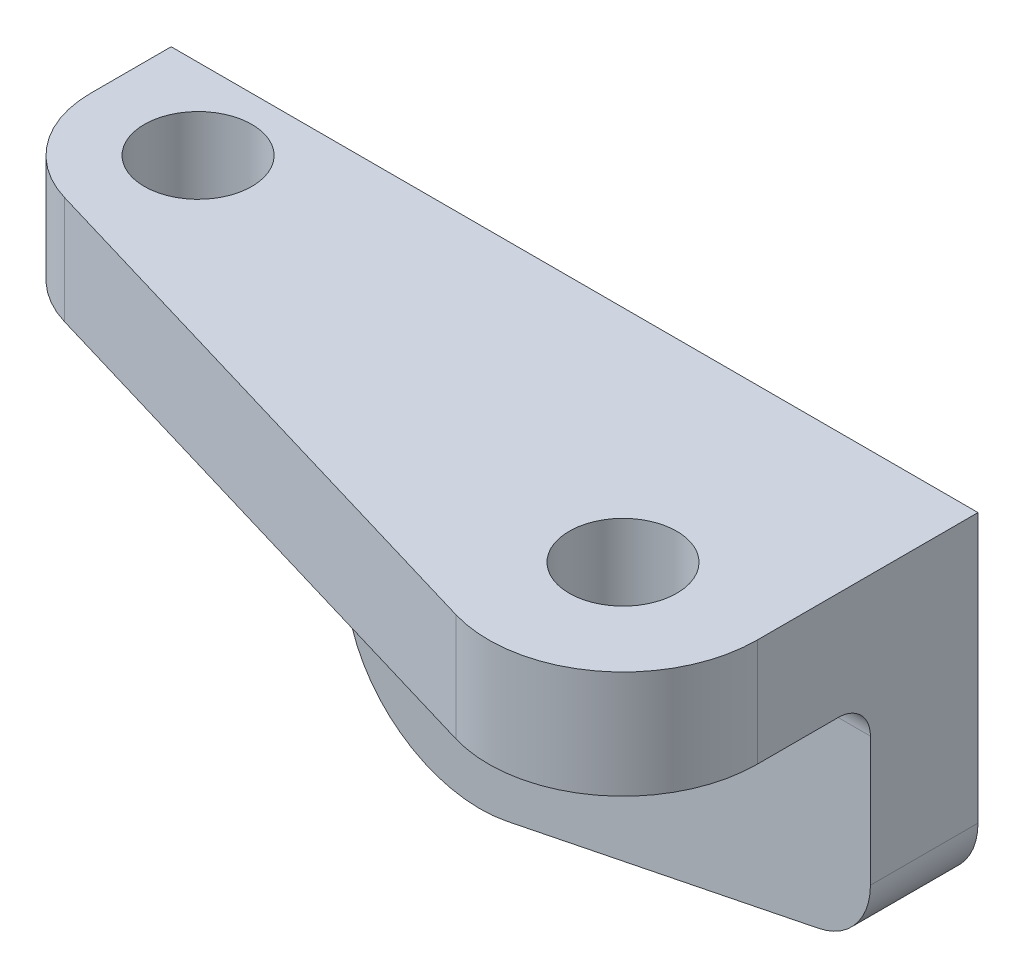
from build123d import *

# Parameters (mm, degrees)
SKETCH1_R           = 10
BOSS_EXTRUDE1_DEPTH = 20
SKETCH2_R           = 9
BOSS_EXTRUDE2_DEPTH = 20
FILLET1_R           = 6
FILLET2_R           = 6


with BuildPart() as part:
    # Sketch1 → Boss-Extrude1 (new body)
    with BuildSketch(Plane(origin=(0, 0, 0), x_dir=(1, 0, 0), z_dir=(0, 1, 0))):
        with BuildLine():
            Line((-75, -15), (-75, 0))
            Line((-75, 0), (75, 0))
            Line((75, 0), (75, -41))
            ThreePointArc((75, -41), (64.948130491, -61.03879724), (42.875728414, -64.963404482))
            Line((42.875728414, -64.963404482), (-60.699417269, -34.170723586))
            ThreePointArc((-60.699417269, -34.170723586), (-71.031037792, -26.958504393), (-75, -15))
        make_face()
        with Locations(Location((-55, -15, 0), (0, 0, 270))):
            Circle(SKETCH1_R, mode=Mode.SUBTRACT)
        with Locations(Location((50, -41, 0), (0, 0, 270))):
            Circle(SKETCH1_R, mode=Mode.SUBTRACT)
    extrude(amount=BOSS_EXTRUDE1_DEPTH)

    # Sketch2 → Boss-Extrude2 (add)
    with BuildSketch(Plane(origin=(0, 0, 0), x_dir=(-1, 0, 0), z_dir=(0, 0, -1))):
        with BuildLine():
            Line((-75, 0), (22.579399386, 0))
            Line((22.579399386, 0), (22.579399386, -29))
            ThreePointArc((22.579399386, -29), (13.406439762, -48.352126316), (-7.380984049, -53.502950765))
            Line((-7.380984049, -53.502950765), (-65.380984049, -41.761416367))
            ThreePointArc((-65.380984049, -41.761416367), (-72.289020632, -37.59697938), (-75, -30))
            Line((-75, -30), (-75, 0))
        make_face()
        with Locations((-2.420600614, -29)):
            Circle(SKETCH2_R, mode=Mode.SUBTRACT)
    extrude(amount=-BOSS_EXTRUDE2_DEPTH)

    # Fillet1
    fillet1_edges = [part.edges().sort_by_distance(p)[0] for p in [
        (-22.579399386, 0, 10),
    ]]
    fillet(fillet1_edges, radius=FILLET1_R)

    # Fillet2
    fillet2_edges = [part.edges().sort_by_distance(p)[0] for p in [
        (23.210300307, 0, 20),
    ]]
    fillet(fillet2_edges, radius=FILLET2_R)


solid = part.part
